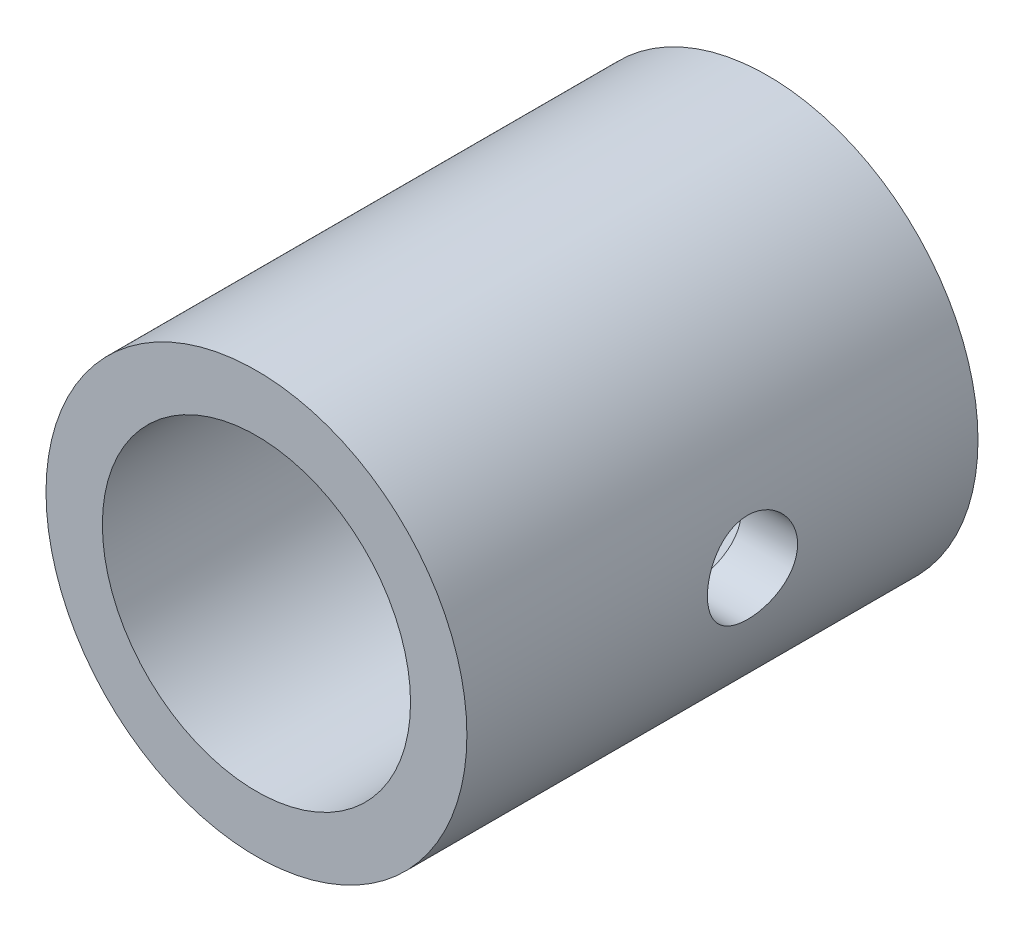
from build123d import *

# Parameters (mm, degrees)
ESQUISSE1_R                  = 14
ESQUISSE1_R_2                = 10.25
EXTRUSION1_DEPTH             = 34
ENL_V_MAT_EXTRU_1_DEPTH      = 40.344631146
ENL_V_MAT_EXTRU_1_DEPTH_BACK = 40.344631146
ESQUISSE2_R                  = 3


with BuildPart() as part:
    # Esquisse1 → Extrusion1 (new body)
    with BuildSketch(Plane.XY):
        Circle(ESQUISSE1_R)
        Circle(ESQUISSE1_R_2, mode=Mode.SUBTRACT)
    extrude(amount=EXTRUSION1_DEPTH)

    # Esquisse2 → Enl_v. mat.-Extru.1 (cut, two sides: drawn at the far end of the back side and taken through both)
    with BuildSketch(Plane(origin=(0, 0, 0), x_dir=(0, 0, -1), z_dir=(1, 0, 0)).offset(-ENL_V_MAT_EXTRU_1_DEPTH_BACK)):
        with Locations((-15, 0)):
            Circle(ESQUISSE2_R)
    extrude(amount=ENL_V_MAT_EXTRU_1_DEPTH + ENL_V_MAT_EXTRU_1_DEPTH_BACK, mode=Mode.SUBTRACT)


solid = part.part
